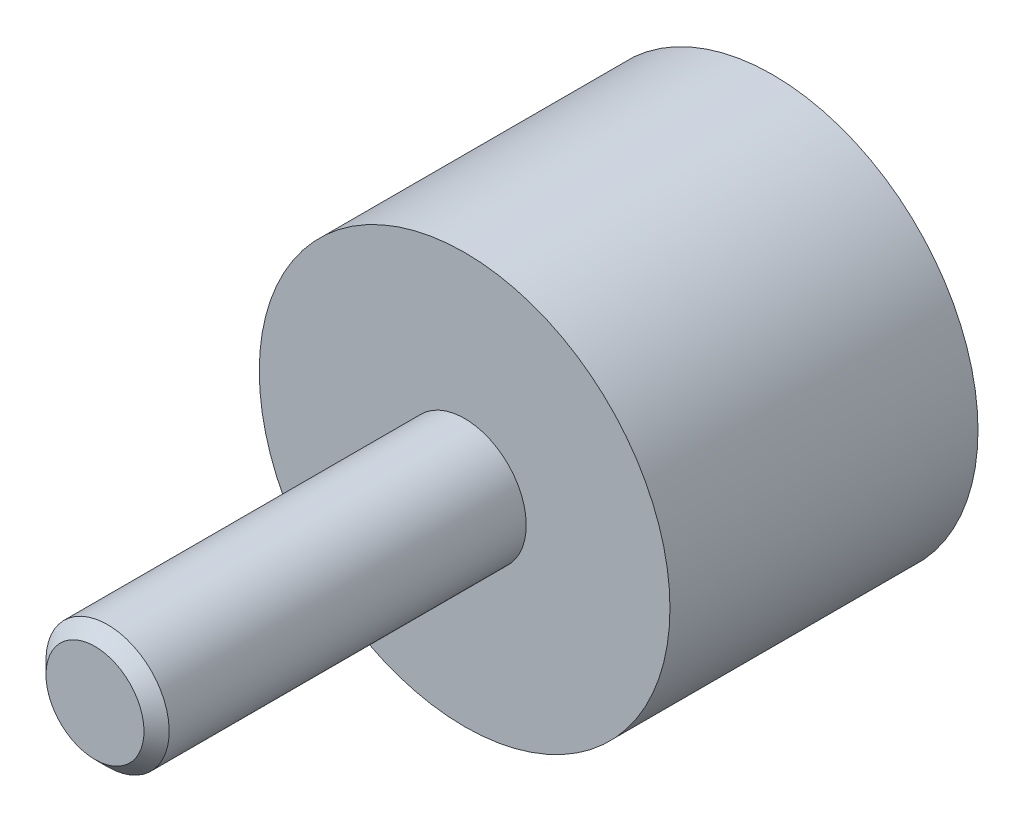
ISO-10303-21;
HEADER;
FILE_DESCRIPTION(('STEP AP214'),'2;1');
FILE_NAME('part.step','',(''),(''),'','','');
FILE_SCHEMA(('AUTOMOTIVE_DESIGN { 1 0 10303 214 1 1 1 1 }'));
ENDSEC;
DATA;
#1=APPLICATION_CONTEXT('core data for automotive mechanical design processes');
#2=APPLICATION_PROTOCOL_DEFINITION('international standard','automotive_design',2000,#1);
#3=PRODUCT_CONTEXT('',#1,'mechanical');
#4=PRODUCT('Part','Part','',(#3));
#5=PRODUCT_RELATED_PRODUCT_CATEGORY('part','',(#4));
#6=PRODUCT_DEFINITION_FORMATION('','',#4);
#7=PRODUCT_DEFINITION_CONTEXT('part definition',#1,'design');
#8=PRODUCT_DEFINITION('design','',#6,#7);
#9=PRODUCT_DEFINITION_SHAPE('','',#8);
#10=(LENGTH_UNIT() NAMED_UNIT(*) SI_UNIT(.MILLI.,.METRE.));
#11=(NAMED_UNIT(*) PLANE_ANGLE_UNIT() SI_UNIT($,.RADIAN.));
#12=(NAMED_UNIT(*) SI_UNIT($,.STERADIAN.) SOLID_ANGLE_UNIT());
#13=UNCERTAINTY_MEASURE_WITH_UNIT(LENGTH_MEASURE(1.E-05),#10,'distance_accuracy_value','');
#14=(GEOMETRIC_REPRESENTATION_CONTEXT(3) GLOBAL_UNCERTAINTY_ASSIGNED_CONTEXT((#13)) GLOBAL_UNIT_ASSIGNED_CONTEXT((#10,
#11,#12)) REPRESENTATION_CONTEXT('',''));
#15=CARTESIAN_POINT('',(0.,0.,0.));
#16=DIRECTION('',(0.,0.,1.));
#17=DIRECTION('',(1.,0.,0.));
#18=AXIS2_PLACEMENT_3D('',#15,#16,#17);
#19=CARTESIAN_POINT('',(9.3333333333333,0.,15.));
#20=DIRECTION('',(0.,0.,1.));
#21=DIRECTION('',(0.,-1.,0.));
#22=AXIS2_PLACEMENT_3D('',#19,#20,#21);
#23=PLANE('',#22);
#24=CARTESIAN_POINT('',(0.,0.,15.));
#25=DIRECTION('',(0.,0.,1.));
#26=DIRECTION('',(0.,-1.,0.));
#27=AXIS2_PLACEMENT_3D('',#24,#25,#26);
#28=CIRCLE('',#27,3.);
#29=CARTESIAN_POINT('',(0.,-3.,15.));
#30=VERTEX_POINT('',#29);
#31=EDGE_CURVE('E23',#30,#30,#28,.T.);
#32=ORIENTED_EDGE('',*,*,#31,.F.);
#33=EDGE_LOOP('',(#32));
#34=FACE_BOUND('',#33,.T.);
#35=CARTESIAN_POINT('',(0.,0.,15.));
#36=DIRECTION('',(0.,0.,1.));
#37=DIRECTION('',(0.,-1.,0.));
#38=AXIS2_PLACEMENT_3D('',#35,#36,#37);
#39=CIRCLE('',#38,10.);
#40=CARTESIAN_POINT('',(0.,-10.,15.));
#41=VERTEX_POINT('',#40);
#42=EDGE_CURVE('E27',#41,#41,#39,.T.);
#43=ORIENTED_EDGE('',*,*,#42,.T.);
#44=EDGE_LOOP('',(#43));
#45=FACE_BOUND('',#44,.T.);
#46=ADVANCED_FACE('F12',(#34,#45),#23,.T.);
#47=CARTESIAN_POINT('',(0.,0.,0.5));
#48=DIRECTION('',(0.,0.,1.));
#49=DIRECTION('',(0.,-1.,0.));
#50=AXIS2_PLACEMENT_3D('',#47,#48,#49);
#51=CYLINDRICAL_SURFACE('',#50,10.);
#52=CARTESIAN_POINT('',(0.,0.,0.));
#53=DIRECTION('',(0.,0.,1.));
#54=DIRECTION('',(0.,-1.,0.));
#55=AXIS2_PLACEMENT_3D('',#52,#53,#54);
#56=CIRCLE('',#55,10.);
#57=CARTESIAN_POINT('',(0.,-10.,0.));
#58=VERTEX_POINT('',#57);
#59=EDGE_CURVE('E32',#58,#58,#56,.T.);
#60=ORIENTED_EDGE('',*,*,#59,.T.);
#61=EDGE_LOOP('',(#60));
#62=FACE_BOUND('',#61,.T.);
#63=ORIENTED_EDGE('',*,*,#42,.F.);
#64=EDGE_LOOP('',(#63));
#65=FACE_BOUND('',#64,.T.);
#66=ADVANCED_FACE('F63',(#62,#65),#51,.T.);
#67=CARTESIAN_POINT('',(10.,0.,0.));
#68=DIRECTION('',(0.,0.,-1.));
#69=DIRECTION('',(0.,1.,0.));
#70=AXIS2_PLACEMENT_3D('',#67,#68,#69);
#71=PLANE('',#70);
#72=CARTESIAN_POINT('',(0.,0.,0.));
#73=DIRECTION('',(0.,0.,-1.));
#74=DIRECTION('',(0.,1.,0.));
#75=AXIS2_PLACEMENT_3D('',#72,#73,#74);
#76=CIRCLE('',#75,3.45);
#77=CARTESIAN_POINT('',(0.,3.45,0.));
#78=VERTEX_POINT('',#77);
#79=EDGE_CURVE('E8',#78,#78,#76,.F.);
#80=ORIENTED_EDGE('',*,*,#79,.T.);
#81=EDGE_LOOP('',(#80));
#82=FACE_BOUND('',#81,.T.);
#83=ORIENTED_EDGE('',*,*,#59,.F.);
#84=EDGE_LOOP('',(#83));
#85=FACE_BOUND('',#84,.T.);
#86=ADVANCED_FACE('F68',(#82,#85),#71,.T.);
#87=CARTESIAN_POINT('',(0.,0.,33.));
#88=DIRECTION('',(0.,0.,1.));
#89=DIRECTION('',(0.,-1.,0.));
#90=AXIS2_PLACEMENT_3D('',#87,#88,#89);
#91=PLANE('',#90);
#92=CARTESIAN_POINT('',(0.,0.,33.));
#93=DIRECTION('',(0.,0.,1.));
#94=DIRECTION('',(0.,-1.,0.));
#95=AXIS2_PLACEMENT_3D('',#92,#93,#94);
#96=CIRCLE('',#95,2.3865);
#97=CARTESIAN_POINT('',(0.,-2.3865,33.));
#98=VERTEX_POINT('',#97);
#99=EDGE_CURVE('E35',#98,#98,#96,.T.);
#100=ORIENTED_EDGE('',*,*,#99,.T.);
#101=EDGE_LOOP('',(#100));
#102=FACE_BOUND('',#101,.T.);
#103=ADVANCED_FACE('F74',(#102),#91,.T.);
#104=CARTESIAN_POINT('',(0.,0.,33.));
#105=DIRECTION('',(0.,0.,-1.));
#106=DIRECTION('',(0.,1.,0.));
#107=AXIS2_PLACEMENT_3D('',#104,#105,#106);
#108=CONICAL_SURFACE('',#107,2.3865,0.785398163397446);
#109=CARTESIAN_POINT('',(0.,0.,32.3865));
#110=DIRECTION('',(0.,0.,1.));
#111=DIRECTION('',(0.,-1.,0.));
#112=AXIS2_PLACEMENT_3D('',#109,#110,#111);
#113=CIRCLE('',#112,3.);
#114=CARTESIAN_POINT('',(0.,-3.,32.3865));
#115=VERTEX_POINT('',#114);
#116=EDGE_CURVE('E38',#115,#115,#113,.T.);
#117=ORIENTED_EDGE('',*,*,#116,.T.);
#118=EDGE_LOOP('',(#117));
#119=FACE_BOUND('',#118,.T.);
#120=ORIENTED_EDGE('',*,*,#99,.F.);
#121=EDGE_LOOP('',(#120));
#122=FACE_BOUND('',#121,.T.);
#123=ADVANCED_FACE('F57',(#119,#122),#108,.T.);
#124=CARTESIAN_POINT('',(0.,0.,15.));
#125=DIRECTION('',(0.,0.,1.));
#126=DIRECTION('',(0.,-1.,0.));
#127=AXIS2_PLACEMENT_3D('',#124,#125,#126);
#128=CYLINDRICAL_SURFACE('',#127,3.);
#129=ORIENTED_EDGE('',*,*,#31,.T.);
#130=EDGE_LOOP('',(#129));
#131=FACE_BOUND('',#130,.T.);
#132=ORIENTED_EDGE('',*,*,#116,.F.);
#133=EDGE_LOOP('',(#132));
#134=FACE_BOUND('',#133,.T.);
#135=ADVANCED_FACE('F49',(#131,#134),#128,.T.);
#136=CARTESIAN_POINT('',(0.,0.,0.));
#137=DIRECTION('',(0.,0.,1.));
#138=DIRECTION('',(0.,-1.,0.));
#139=AXIS2_PLACEMENT_3D('',#136,#137,#138);
#140=CYLINDRICAL_SURFACE('',#139,3.);
#141=CARTESIAN_POINT('',(0.,0.,0.45));
#142=DIRECTION('',(0.,0.,-1.));
#143=DIRECTION('',(0.,1.,0.));
#144=AXIS2_PLACEMENT_3D('',#141,#142,#143);
#145=CIRCLE('',#144,3.);
#146=CARTESIAN_POINT('',(0.,3.,0.45));
#147=VERTEX_POINT('',#146);
#148=EDGE_CURVE('E19',#147,#147,#145,.T.);
#149=ORIENTED_EDGE('',*,*,#148,.T.);
#150=EDGE_LOOP('',(#149));
#151=FACE_BOUND('',#150,.T.);
#152=CARTESIAN_POINT('',(0.,0.,6.));
#153=DIRECTION('',(0.,0.,-1.));
#154=DIRECTION('',(0.,1.,0.));
#155=AXIS2_PLACEMENT_3D('',#152,#153,#154);
#156=CIRCLE('',#155,3.);
#157=CARTESIAN_POINT('',(0.,3.,6.));
#158=VERTEX_POINT('',#157);
#159=EDGE_CURVE('E41',#158,#158,#156,.T.);
#160=ORIENTED_EDGE('',*,*,#159,.F.);
#161=EDGE_LOOP('',(#160));
#162=FACE_BOUND('',#161,.T.);
#163=ADVANCED_FACE('F47',(#151,#162),#140,.F.);
#164=CARTESIAN_POINT('',(0.,0.,6.));
#165=DIRECTION('',(0.,0.,-1.));
#166=DIRECTION('',(0.,1.,0.));
#167=AXIS2_PLACEMENT_3D('',#164,#165,#166);
#168=PLANE('',#167);
#169=ORIENTED_EDGE('',*,*,#159,.T.);
#170=EDGE_LOOP('',(#169));
#171=FACE_BOUND('',#170,.T.);
#172=ADVANCED_FACE('F45',(#171),#168,.T.);
#173=CARTESIAN_POINT('',(0.,0.,0.45));
#174=DIRECTION('',(0.,0.,-1.));
#175=DIRECTION('',(0.,1.,0.));
#176=AXIS2_PLACEMENT_3D('',#173,#174,#175);
#177=CONICAL_SURFACE('',#176,3.,0.785398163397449);
#178=ORIENTED_EDGE('',*,*,#79,.F.);
#179=EDGE_LOOP('',(#178));
#180=FACE_BOUND('',#179,.T.);
#181=ORIENTED_EDGE('',*,*,#148,.F.);
#182=EDGE_LOOP('',(#181));
#183=FACE_BOUND('',#182,.T.);
#184=ADVANCED_FACE('F14',(#180,#183),#177,.F.);
#185=CLOSED_SHELL('',(#46,#66,#86,#103,#123,#135,#163,#172,#184));
#186=MANIFOLD_SOLID_BREP('B1',#185);
#187=ADVANCED_BREP_SHAPE_REPRESENTATION('',(#18,#186),#14);
#188=SHAPE_DEFINITION_REPRESENTATION(#9,#187);
ENDSEC;
END-ISO-10303-21;
